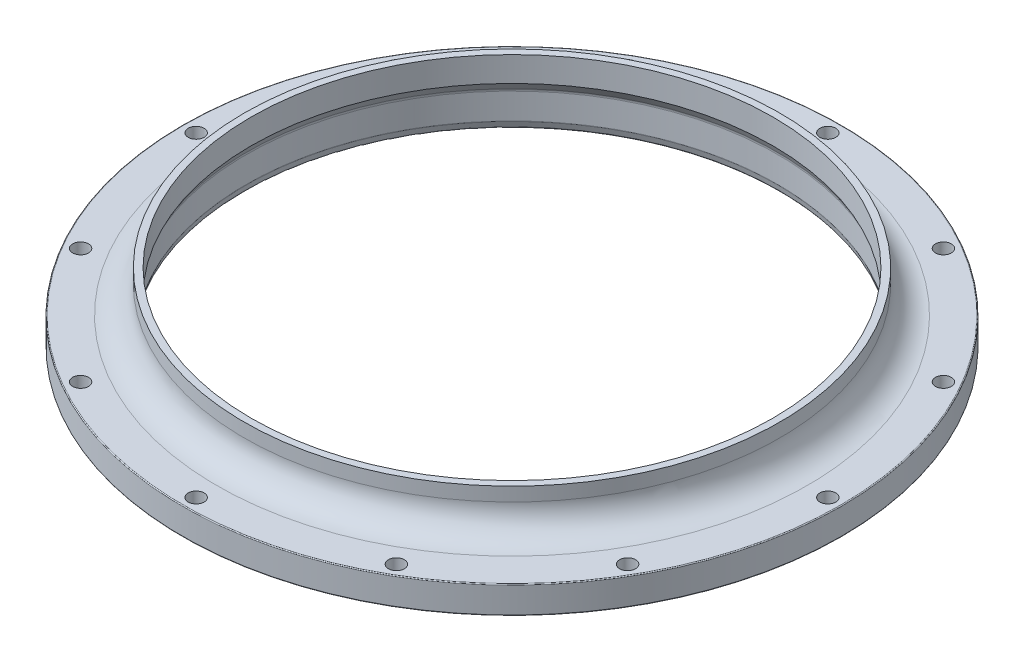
ISO-10303-21;
HEADER;
FILE_DESCRIPTION(('STEP AP214'),'2;1');
FILE_NAME('part.step','',(''),(''),'','','');
FILE_SCHEMA(('AUTOMOTIVE_DESIGN { 1 0 10303 214 1 1 1 1 }'));
ENDSEC;
DATA;
#1=APPLICATION_CONTEXT('core data for automotive mechanical design processes');
#2=APPLICATION_PROTOCOL_DEFINITION('international standard','automotive_design',2000,#1);
#3=PRODUCT_CONTEXT('',#1,'mechanical');
#4=PRODUCT('Part','Part','',(#3));
#5=PRODUCT_RELATED_PRODUCT_CATEGORY('part','',(#4));
#6=PRODUCT_DEFINITION_FORMATION('','',#4);
#7=PRODUCT_DEFINITION_CONTEXT('part definition',#1,'design');
#8=PRODUCT_DEFINITION('design','',#6,#7);
#9=PRODUCT_DEFINITION_SHAPE('','',#8);
#10=(LENGTH_UNIT() NAMED_UNIT(*) SI_UNIT(.MILLI.,.METRE.));
#11=(NAMED_UNIT(*) PLANE_ANGLE_UNIT() SI_UNIT($,.RADIAN.));
#12=(NAMED_UNIT(*) SI_UNIT($,.STERADIAN.) SOLID_ANGLE_UNIT());
#13=UNCERTAINTY_MEASURE_WITH_UNIT(LENGTH_MEASURE(1.E-05),#10,'distance_accuracy_value','');
#14=(GEOMETRIC_REPRESENTATION_CONTEXT(3) GLOBAL_UNCERTAINTY_ASSIGNED_CONTEXT((#13)) GLOBAL_UNIT_ASSIGNED_CONTEXT((#10,
#11,#12)) REPRESENTATION_CONTEXT('',''));
#15=CARTESIAN_POINT('',(0.,0.,0.));
#16=DIRECTION('',(0.,0.,1.));
#17=DIRECTION('',(1.,0.,0.));
#18=AXIS2_PLACEMENT_3D('',#15,#16,#17);
#19=CARTESIAN_POINT('',(0.,0.,0.));
#20=DIRECTION('',(0.,-1.,0.));
#21=DIRECTION('',(-1.,0.,0.));
#22=AXIS2_PLACEMENT_3D('',#19,#20,#21);
#23=CYLINDRICAL_SURFACE('',#22,241.3);
#24=CARTESIAN_POINT('',(0.,-247.65,0.));
#25=DIRECTION('',(0.,1.,0.));
#26=DIRECTION('',(-1.,0.,0.));
#27=AXIS2_PLACEMENT_3D('',#24,#25,#26);
#28=CIRCLE('',#27,241.3);
#29=CARTESIAN_POINT('',(-241.3,-247.65,0.));
#30=VERTEX_POINT('',#29);
#31=EDGE_CURVE('E46',#30,#30,#28,.T.);
#32=ORIENTED_EDGE('',*,*,#31,.T.);
#33=EDGE_LOOP('',(#32));
#34=FACE_BOUND('',#33,.T.);
#35=CARTESIAN_POINT('',(0.,-270.747029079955,0.));
#36=DIRECTION('',(0.,1.,0.));
#37=DIRECTION('',(0.,0.,1.));
#38=AXIS2_PLACEMENT_3D('',#35,#36,#37);
#39=CIRCLE('',#38,241.3);
#40=CARTESIAN_POINT('',(0.,-270.747029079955,241.3));
#41=VERTEX_POINT('',#40);
#42=EDGE_CURVE('E145',#41,#41,#39,.T.);
#43=ORIENTED_EDGE('',*,*,#42,.F.);
#44=EDGE_LOOP('',(#43));
#45=FACE_BOUND('',#44,.T.);
#46=ADVANCED_FACE('F35',(#34,#45),#23,.F.);
#47=CARTESIAN_POINT('',(241.3,-247.65,0.));
#48=DIRECTION('',(0.,-1.,0.));
#49=DIRECTION('',(-1.,0.,0.));
#50=AXIS2_PLACEMENT_3D('',#47,#48,#49);
#51=PLANE('',#50);
#52=CARTESIAN_POINT('',(0.,-247.65,0.));
#53=DIRECTION('',(0.,1.,0.));
#54=DIRECTION('',(-1.,0.,0.));
#55=AXIS2_PLACEMENT_3D('',#52,#53,#54);
#56=CIRCLE('',#55,247.65);
#57=CARTESIAN_POINT('',(-247.65,-247.65,0.));
#58=VERTEX_POINT('',#57);
#59=EDGE_CURVE('E89',#58,#58,#56,.T.);
#60=ORIENTED_EDGE('',*,*,#59,.T.);
#61=EDGE_LOOP('',(#60));
#62=FACE_BOUND('',#61,.T.);
#63=ORIENTED_EDGE('',*,*,#31,.F.);
#64=EDGE_LOOP('',(#63));
#65=FACE_BOUND('',#64,.T.);
#66=ADVANCED_FACE('F177',(#62,#65),#51,.F.);
#67=CARTESIAN_POINT('',(304.00625,-311.15,0.));
#68=DIRECTION('',(0.,1.,0.));
#69=DIRECTION('',(1.,0.,0.));
#70=AXIS2_PLACEMENT_3D('',#67,#68,#69);
#71=PLANE('',#70);
#72=CARTESIAN_POINT('',(0.,-311.15,0.));
#73=DIRECTION('',(0.,1.,0.));
#74=DIRECTION('',(-1.,0.,0.));
#75=AXIS2_PLACEMENT_3D('',#72,#73,#74);
#76=CIRCLE('',#75,249.090381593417);
#77=CARTESIAN_POINT('',(-249.090381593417,-311.15,0.));
#78=VERTEX_POINT('',#77);
#79=EDGE_CURVE('E42',#78,#78,#76,.T.);
#80=ORIENTED_EDGE('',*,*,#79,.T.);
#81=EDGE_LOOP('',(#80));
#82=FACE_BOUND('',#81,.T.);
#83=CARTESIAN_POINT('',(-1.40812414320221E-13,-311.15,292.1));
#84=DIRECTION('',(0.,1.,0.));
#85=DIRECTION('',(-1.,0.,0.));
#86=AXIS2_PLACEMENT_3D('',#83,#84,#85);
#87=CIRCLE('',#86,7.34186999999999);
#88=CARTESIAN_POINT('',(-7.34187000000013,-311.15,292.1));
#89=VERTEX_POINT('',#88);
#90=EDGE_CURVE('E53',#89,#89,#87,.T.);
#91=ORIENTED_EDGE('',*,*,#90,.T.);
#92=EDGE_LOOP('',(#91));
#93=FACE_BOUND('',#92,.T.);
#94=CARTESIAN_POINT('',(-146.05,-311.15,252.966020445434));
#95=DIRECTION('',(0.,1.,0.));
#96=DIRECTION('',(-1.,0.,0.));
#97=AXIS2_PLACEMENT_3D('',#94,#95,#96);
#98=CIRCLE('',#97,7.34187);
#99=CARTESIAN_POINT('',(-153.39187,-311.15,252.966020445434));
#100=VERTEX_POINT('',#99);
#101=EDGE_CURVE('E58',#100,#100,#98,.T.);
#102=ORIENTED_EDGE('',*,*,#101,.T.);
#103=EDGE_LOOP('',(#102));
#104=FACE_BOUND('',#103,.T.);
#105=CARTESIAN_POINT('',(-252.966020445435,-311.15,146.049999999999));
#106=DIRECTION('',(0.,1.,0.));
#107=DIRECTION('',(-1.,0.,0.));
#108=AXIS2_PLACEMENT_3D('',#105,#106,#107);
#109=CIRCLE('',#108,7.34187);
#110=CARTESIAN_POINT('',(-260.307890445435,-311.15,146.049999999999));
#111=VERTEX_POINT('',#110);
#112=EDGE_CURVE('E136',#111,#111,#109,.T.);
#113=ORIENTED_EDGE('',*,*,#112,.T.);
#114=EDGE_LOOP('',(#113));
#115=FACE_BOUND('',#114,.T.);
#116=CARTESIAN_POINT('',(-292.1,-311.15,-1.12410081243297E-12));
#117=DIRECTION('',(0.,1.,0.));
#118=DIRECTION('',(-1.,0.,0.));
#119=AXIS2_PLACEMENT_3D('',#116,#117,#118);
#120=CIRCLE('',#119,7.34186999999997);
#121=CARTESIAN_POINT('',(-299.44187,-311.15,-1.12410081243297E-12));
#122=VERTEX_POINT('',#121);
#123=EDGE_CURVE('E62',#122,#122,#120,.T.);
#124=ORIENTED_EDGE('',*,*,#123,.T.);
#125=EDGE_LOOP('',(#124));
#126=FACE_BOUND('',#125,.T.);
#127=CARTESIAN_POINT('',(-252.966020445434,-311.15,-146.050000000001));
#128=DIRECTION('',(0.,1.,0.));
#129=DIRECTION('',(-1.,0.,0.));
#130=AXIS2_PLACEMENT_3D('',#127,#128,#129);
#131=CIRCLE('',#130,7.34187);
#132=CARTESIAN_POINT('',(-260.307890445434,-311.15,-146.050000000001));
#133=VERTEX_POINT('',#132);
#134=EDGE_CURVE('E129',#133,#133,#131,.T.);
#135=ORIENTED_EDGE('',*,*,#134,.T.);
#136=EDGE_LOOP('',(#135));
#137=FACE_BOUND('',#136,.T.);
#138=CARTESIAN_POINT('',(-146.049999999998,-311.15,-252.966020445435));
#139=DIRECTION('',(0.,1.,0.));
#140=DIRECTION('',(-1.,0.,0.));
#141=AXIS2_PLACEMENT_3D('',#138,#139,#140);
#142=CIRCLE('',#141,7.34187);
#143=CARTESIAN_POINT('',(-153.391869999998,-311.15,-252.966020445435));
#144=VERTEX_POINT('',#143);
#145=EDGE_CURVE('E123',#144,#144,#142,.T.);
#146=ORIENTED_EDGE('',*,*,#145,.T.);
#147=EDGE_LOOP('',(#146));
#148=FACE_BOUND('',#147,.T.);
#149=CARTESIAN_POINT('',(2.10218504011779E-12,-311.15,-292.1));
#150=DIRECTION('',(0.,1.,0.));
#151=DIRECTION('',(-1.,0.,0.));
#152=AXIS2_PLACEMENT_3D('',#149,#150,#151);
#153=CIRCLE('',#152,7.34186999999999);
#154=CARTESIAN_POINT('',(-7.34186999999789,-311.15,-292.1));
#155=VERTEX_POINT('',#154);
#156=EDGE_CURVE('E67',#155,#155,#153,.T.);
#157=ORIENTED_EDGE('',*,*,#156,.T.);
#158=EDGE_LOOP('',(#157));
#159=FACE_BOUND('',#158,.T.);
#160=CARTESIAN_POINT('',(146.050000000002,-311.15,-252.966020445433));
#161=DIRECTION('',(0.,1.,0.));
#162=DIRECTION('',(-1.,0.,0.));
#163=AXIS2_PLACEMENT_3D('',#160,#161,#162);
#164=CIRCLE('',#163,7.34187);
#165=CARTESIAN_POINT('',(138.708130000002,-311.15,-252.966020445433));
#166=VERTEX_POINT('',#165);
#167=EDGE_CURVE('E116',#166,#166,#164,.T.);
#168=ORIENTED_EDGE('',*,*,#167,.T.);
#169=EDGE_LOOP('',(#168));
#170=FACE_BOUND('',#169,.T.);
#171=CARTESIAN_POINT('',(252.966020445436,-311.15,-146.049999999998));
#172=DIRECTION('',(0.,1.,0.));
#173=DIRECTION('',(-1.,0.,0.));
#174=AXIS2_PLACEMENT_3D('',#171,#172,#173);
#175=CIRCLE('',#174,7.34186999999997);
#176=CARTESIAN_POINT('',(245.624150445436,-311.15,-146.049999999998));
#177=VERTEX_POINT('',#176);
#178=EDGE_CURVE('E110',#177,#177,#175,.T.);
#179=ORIENTED_EDGE('',*,*,#178,.T.);
#180=EDGE_LOOP('',(#179));
#181=FACE_BOUND('',#180,.T.);
#182=CARTESIAN_POINT('',(292.1,-311.15,3.1641356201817E-12));
#183=DIRECTION('',(0.,1.,0.));
#184=DIRECTION('',(-1.,0.,0.));
#185=AXIS2_PLACEMENT_3D('',#182,#183,#184);
#186=CIRCLE('',#185,7.34186999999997);
#187=CARTESIAN_POINT('',(284.75813,-311.15,3.1641356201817E-12));
#188=VERTEX_POINT('',#187);
#189=EDGE_CURVE('E104',#188,#188,#186,.T.);
#190=ORIENTED_EDGE('',*,*,#189,.T.);
#191=EDGE_LOOP('',(#190));
#192=FACE_BOUND('',#191,.T.);
#193=CARTESIAN_POINT('',(252.966020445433,-311.15,146.050000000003));
#194=DIRECTION('',(0.,1.,0.));
#195=DIRECTION('',(-1.,0.,0.));
#196=AXIS2_PLACEMENT_3D('',#193,#194,#195);
#197=CIRCLE('',#196,7.34186999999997);
#198=CARTESIAN_POINT('',(245.624150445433,-311.15,146.050000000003));
#199=VERTEX_POINT('',#198);
#200=EDGE_CURVE('E98',#199,#199,#197,.T.);
#201=ORIENTED_EDGE('',*,*,#200,.T.);
#202=EDGE_LOOP('',(#201));
#203=FACE_BOUND('',#202,.T.);
#204=CARTESIAN_POINT('',(146.049999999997,-311.15,252.966020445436));
#205=DIRECTION('',(0.,1.,0.));
#206=DIRECTION('',(-1.,0.,0.));
#207=AXIS2_PLACEMENT_3D('',#204,#205,#206);
#208=CIRCLE('',#207,7.34187);
#209=CARTESIAN_POINT('',(138.708129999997,-311.15,252.966020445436));
#210=VERTEX_POINT('',#209);
#211=EDGE_CURVE('E92',#210,#210,#208,.T.);
#212=ORIENTED_EDGE('',*,*,#211,.T.);
#213=EDGE_LOOP('',(#212));
#214=FACE_BOUND('',#213,.T.);
#215=CARTESIAN_POINT('',(0.,-311.15,0.));
#216=DIRECTION('',(0.,1.,0.));
#217=DIRECTION('',(-1.,0.,0.));
#218=AXIS2_PLACEMENT_3D('',#215,#216,#217);
#219=CIRCLE('',#218,304.00625);
#220=CARTESIAN_POINT('',(-304.00625,-311.15,0.));
#221=VERTEX_POINT('',#220);
#222=EDGE_CURVE('E50',#221,#221,#219,.T.);
#223=ORIENTED_EDGE('',*,*,#222,.F.);
#224=EDGE_LOOP('',(#223));
#225=FACE_BOUND('',#224,.T.);
#226=ADVANCED_FACE('F183',(#82,#93,#104,#115,#126,#137,#148,#159,#170,#181,#192,#203,#214,#225),
#71,.F.);
#227=CARTESIAN_POINT('',(0.,-310.35625,0.));
#228=DIRECTION('',(0.,-1.,0.));
#229=DIRECTION('',(-1.,0.,0.));
#230=AXIS2_PLACEMENT_3D('',#227,#228,#229);
#231=TOROIDAL_SURFACE('',#230,304.00625,0.793749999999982);
#232=ORIENTED_EDGE('',*,*,#222,.T.);
#233=EDGE_LOOP('',(#232));
#234=FACE_BOUND('',#233,.T.);
#235=CARTESIAN_POINT('',(0.,-310.35625,0.));
#236=DIRECTION('',(0.,1.,0.));
#237=DIRECTION('',(-1.,0.,0.));
#238=AXIS2_PLACEMENT_3D('',#235,#236,#237);
#239=CIRCLE('',#238,304.8);
#240=CARTESIAN_POINT('',(-304.8,-310.35625,0.));
#241=VERTEX_POINT('',#240);
#242=EDGE_CURVE('E74',#241,#241,#239,.T.);
#243=ORIENTED_EDGE('',*,*,#242,.F.);
#244=EDGE_LOOP('',(#243));
#245=FACE_BOUND('',#244,.T.);
#246=ADVANCED_FACE('F189',(#234,#245),#231,.T.);
#247=CARTESIAN_POINT('',(0.,0.,0.));
#248=DIRECTION('',(0.,-1.,0.));
#249=DIRECTION('',(-1.,0.,0.));
#250=AXIS2_PLACEMENT_3D('',#247,#248,#249);
#251=CYLINDRICAL_SURFACE('',#250,304.8);
#252=ORIENTED_EDGE('',*,*,#242,.T.);
#253=EDGE_LOOP('',(#252));
#254=FACE_BOUND('',#253,.T.);
#255=CARTESIAN_POINT('',(0.,-286.54375,0.));
#256=DIRECTION('',(0.,1.,0.));
#257=DIRECTION('',(-1.,0.,0.));
#258=AXIS2_PLACEMENT_3D('',#255,#256,#257);
#259=CIRCLE('',#258,304.8);
#260=CARTESIAN_POINT('',(-304.8,-286.54375,0.));
#261=VERTEX_POINT('',#260);
#262=EDGE_CURVE('E77',#261,#261,#259,.T.);
#263=ORIENTED_EDGE('',*,*,#262,.F.);
#264=EDGE_LOOP('',(#263));
#265=FACE_BOUND('',#264,.T.);
#266=ADVANCED_FACE('F192',(#254,#265),#251,.T.);
#267=CARTESIAN_POINT('',(0.,-286.54375,0.));
#268=DIRECTION('',(0.,-1.,0.));
#269=DIRECTION('',(-1.,0.,0.));
#270=AXIS2_PLACEMENT_3D('',#267,#268,#269);
#271=TOROIDAL_SURFACE('',#270,304.00625,0.793749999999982);
#272=ORIENTED_EDGE('',*,*,#262,.T.);
#273=EDGE_LOOP('',(#272));
#274=FACE_BOUND('',#273,.T.);
#275=CARTESIAN_POINT('',(0.,-285.75,0.));
#276=DIRECTION('',(0.,1.,0.));
#277=DIRECTION('',(-1.,0.,0.));
#278=AXIS2_PLACEMENT_3D('',#275,#276,#277);
#279=CIRCLE('',#278,304.00625);
#280=CARTESIAN_POINT('',(-304.00625,-285.75,0.));
#281=VERTEX_POINT('',#280);
#282=EDGE_CURVE('E80',#281,#281,#279,.T.);
#283=ORIENTED_EDGE('',*,*,#282,.F.);
#284=EDGE_LOOP('',(#283));
#285=FACE_BOUND('',#284,.T.);
#286=ADVANCED_FACE('F196',(#274,#285),#271,.T.);
#287=CARTESIAN_POINT('',(273.05,-285.75,0.));
#288=DIRECTION('',(0.,-1.,0.));
#289=DIRECTION('',(-1.,0.,0.));
#290=AXIS2_PLACEMENT_3D('',#287,#288,#289);
#291=PLANE('',#290);
#292=CARTESIAN_POINT('',(-1.40812414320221E-13,-285.75,292.1));
#293=DIRECTION('',(0.,1.,0.));
#294=DIRECTION('',(0.,0.,1.));
#295=AXIS2_PLACEMENT_3D('',#292,#293,#294);
#296=CIRCLE('',#295,7.34187);
#297=CARTESIAN_POINT('',(-1.40812414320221E-13,-285.75,299.44187));
#298=VERTEX_POINT('',#297);
#299=EDGE_CURVE('E57',#298,#298,#296,.T.);
#300=ORIENTED_EDGE('',*,*,#299,.F.);
#301=EDGE_LOOP('',(#300));
#302=FACE_BOUND('',#301,.T.);
#303=CARTESIAN_POINT('',(-146.05,-285.75,252.966020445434));
#304=DIRECTION('',(0.,1.,0.));
#305=DIRECTION('',(0.,0.,1.));
#306=AXIS2_PLACEMENT_3D('',#303,#304,#305);
#307=CIRCLE('',#306,7.34187);
#308=CARTESIAN_POINT('',(-146.05,-285.75,260.307890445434));
#309=VERTEX_POINT('',#308);
#310=EDGE_CURVE('E56',#309,#309,#307,.T.);
#311=ORIENTED_EDGE('',*,*,#310,.F.);
#312=EDGE_LOOP('',(#311));
#313=FACE_BOUND('',#312,.T.);
#314=CARTESIAN_POINT('',(-252.966020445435,-285.75,146.049999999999));
#315=DIRECTION('',(0.,1.,0.));
#316=DIRECTION('',(0.,0.,1.));
#317=AXIS2_PLACEMENT_3D('',#314,#315,#316);
#318=CIRCLE('',#317,7.34187);
#319=CARTESIAN_POINT('',(-252.966020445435,-285.75,153.391869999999));
#320=VERTEX_POINT('',#319);
#321=EDGE_CURVE('E61',#320,#320,#318,.T.);
#322=ORIENTED_EDGE('',*,*,#321,.F.);
#323=EDGE_LOOP('',(#322));
#324=FACE_BOUND('',#323,.T.);
#325=CARTESIAN_POINT('',(-292.1,-285.75,-1.12410081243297E-12));
#326=DIRECTION('',(0.,1.,0.));
#327=DIRECTION('',(0.,0.,1.));
#328=AXIS2_PLACEMENT_3D('',#325,#326,#327);
#329=CIRCLE('',#328,7.34186999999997);
#330=CARTESIAN_POINT('',(-292.1,-285.75,7.34186999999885));
#331=VERTEX_POINT('',#330);
#332=EDGE_CURVE('E66',#331,#331,#329,.T.);
#333=ORIENTED_EDGE('',*,*,#332,.F.);
#334=EDGE_LOOP('',(#333));
#335=FACE_BOUND('',#334,.T.);
#336=CARTESIAN_POINT('',(-252.966020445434,-285.75,-146.050000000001));
#337=DIRECTION('',(0.,1.,0.));
#338=DIRECTION('',(0.,0.,1.));
#339=AXIS2_PLACEMENT_3D('',#336,#337,#338);
#340=CIRCLE('',#339,7.34187);
#341=CARTESIAN_POINT('',(-252.966020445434,-285.75,-138.708130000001));
#342=VERTEX_POINT('',#341);
#343=EDGE_CURVE('E65',#342,#342,#340,.T.);
#344=ORIENTED_EDGE('',*,*,#343,.F.);
#345=EDGE_LOOP('',(#344));
#346=FACE_BOUND('',#345,.T.);
#347=CARTESIAN_POINT('',(-146.049999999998,-285.75,-252.966020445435));
#348=DIRECTION('',(0.,1.,0.));
#349=DIRECTION('',(0.,0.,1.));
#350=AXIS2_PLACEMENT_3D('',#347,#348,#349);
#351=CIRCLE('',#350,7.34187);
#352=CARTESIAN_POINT('',(-146.049999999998,-285.75,-245.624150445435));
#353=VERTEX_POINT('',#352);
#354=EDGE_CURVE('E126',#353,#353,#351,.T.);
#355=ORIENTED_EDGE('',*,*,#354,.F.);
#356=EDGE_LOOP('',(#355));
#357=FACE_BOUND('',#356,.T.);
#358=CARTESIAN_POINT('',(2.10218504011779E-12,-285.75,-292.1));
#359=DIRECTION('',(0.,1.,0.));
#360=DIRECTION('',(0.,0.,1.));
#361=AXIS2_PLACEMENT_3D('',#358,#359,#360);
#362=CIRCLE('',#361,7.34187);
#363=CARTESIAN_POINT('',(2.10218504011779E-12,-285.75,-284.75813));
#364=VERTEX_POINT('',#363);
#365=EDGE_CURVE('E70',#364,#364,#362,.T.);
#366=ORIENTED_EDGE('',*,*,#365,.F.);
#367=EDGE_LOOP('',(#366));
#368=FACE_BOUND('',#367,.T.);
#369=CARTESIAN_POINT('',(146.050000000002,-285.75,-252.966020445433));
#370=DIRECTION('',(0.,1.,0.));
#371=DIRECTION('',(0.,0.,1.));
#372=AXIS2_PLACEMENT_3D('',#369,#370,#371);
#373=CIRCLE('',#372,7.34187);
#374=CARTESIAN_POINT('',(146.050000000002,-285.75,-245.624150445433));
#375=VERTEX_POINT('',#374);
#376=EDGE_CURVE('E69',#375,#375,#373,.T.);
#377=ORIENTED_EDGE('',*,*,#376,.F.);
#378=EDGE_LOOP('',(#377));
#379=FACE_BOUND('',#378,.T.);
#380=CARTESIAN_POINT('',(252.966020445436,-285.75,-146.049999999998));
#381=DIRECTION('',(0.,1.,0.));
#382=DIRECTION('',(0.,0.,1.));
#383=AXIS2_PLACEMENT_3D('',#380,#381,#382);
#384=CIRCLE('',#383,7.34186999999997);
#385=CARTESIAN_POINT('',(252.966020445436,-285.75,-138.708129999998));
#386=VERTEX_POINT('',#385);
#387=EDGE_CURVE('E113',#386,#386,#384,.T.);
#388=ORIENTED_EDGE('',*,*,#387,.F.);
#389=EDGE_LOOP('',(#388));
#390=FACE_BOUND('',#389,.T.);
#391=CARTESIAN_POINT('',(292.1,-285.75,3.1641356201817E-12));
#392=DIRECTION('',(0.,1.,0.));
#393=DIRECTION('',(0.,0.,1.));
#394=AXIS2_PLACEMENT_3D('',#391,#392,#393);
#395=CIRCLE('',#394,7.34186999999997);
#396=CARTESIAN_POINT('',(292.1,-285.75,7.34187000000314));
#397=VERTEX_POINT('',#396);
#398=EDGE_CURVE('E107',#397,#397,#395,.T.);
#399=ORIENTED_EDGE('',*,*,#398,.F.);
#400=EDGE_LOOP('',(#399));
#401=FACE_BOUND('',#400,.T.);
#402=CARTESIAN_POINT('',(252.966020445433,-285.75,146.050000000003));
#403=DIRECTION('',(0.,1.,0.));
#404=DIRECTION('',(0.,0.,1.));
#405=AXIS2_PLACEMENT_3D('',#402,#403,#404);
#406=CIRCLE('',#405,7.34186999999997);
#407=CARTESIAN_POINT('',(252.966020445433,-285.75,153.391870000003));
#408=VERTEX_POINT('',#407);
#409=EDGE_CURVE('E101',#408,#408,#406,.T.);
#410=ORIENTED_EDGE('',*,*,#409,.F.);
#411=EDGE_LOOP('',(#410));
#412=FACE_BOUND('',#411,.T.);
#413=CARTESIAN_POINT('',(146.049999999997,-285.75,252.966020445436));
#414=DIRECTION('',(0.,1.,0.));
#415=DIRECTION('',(0.,0.,1.));
#416=AXIS2_PLACEMENT_3D('',#413,#414,#415);
#417=CIRCLE('',#416,7.34187);
#418=CARTESIAN_POINT('',(146.049999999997,-285.75,260.307890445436));
#419=VERTEX_POINT('',#418);
#420=EDGE_CURVE('E95',#419,#419,#417,.T.);
#421=ORIENTED_EDGE('',*,*,#420,.F.);
#422=EDGE_LOOP('',(#421));
#423=FACE_BOUND('',#422,.T.);
#424=ORIENTED_EDGE('',*,*,#282,.T.);
#425=EDGE_LOOP('',(#424));
#426=FACE_BOUND('',#425,.T.);
#427=CARTESIAN_POINT('',(0.,-285.75,0.));
#428=DIRECTION('',(0.,1.,0.));
#429=DIRECTION('',(-1.,0.,0.));
#430=AXIS2_PLACEMENT_3D('',#427,#428,#429);
#431=CIRCLE('',#430,273.05);
#432=CARTESIAN_POINT('',(-273.05,-285.75,0.));
#433=VERTEX_POINT('',#432);
#434=EDGE_CURVE('E83',#433,#433,#431,.T.);
#435=ORIENTED_EDGE('',*,*,#434,.F.);
#436=EDGE_LOOP('',(#435));
#437=FACE_BOUND('',#436,.T.);
#438=ADVANCED_FACE('F200',(#302,#313,#324,#335,#346,#357,#368,#379,#390,#401,#412,#423,#426,
#437),#291,.F.);
#439=CARTESIAN_POINT('',(0.,-260.35,0.));
#440=DIRECTION('',(0.,-1.,0.));
#441=DIRECTION('',(-1.,0.,0.));
#442=AXIS2_PLACEMENT_3D('',#439,#440,#441);
#443=TOROIDAL_SURFACE('',#442,273.05,25.4);
#444=ORIENTED_EDGE('',*,*,#434,.T.);
#445=EDGE_LOOP('',(#444));
#446=FACE_BOUND('',#445,.T.);
#447=CARTESIAN_POINT('',(0.,-260.35,0.));
#448=DIRECTION('',(0.,1.,0.));
#449=DIRECTION('',(-1.,0.,0.));
#450=AXIS2_PLACEMENT_3D('',#447,#448,#449);
#451=CIRCLE('',#450,247.65);
#452=CARTESIAN_POINT('',(-247.65,-260.35,0.));
#453=VERTEX_POINT('',#452);
#454=EDGE_CURVE('E86',#453,#453,#451,.T.);
#455=ORIENTED_EDGE('',*,*,#454,.F.);
#456=EDGE_LOOP('',(#455));
#457=FACE_BOUND('',#456,.T.);
#458=ADVANCED_FACE('F204',(#446,#457),#443,.F.);
#459=CARTESIAN_POINT('',(0.,0.,0.));
#460=DIRECTION('',(0.,-1.,0.));
#461=DIRECTION('',(-1.,0.,0.));
#462=AXIS2_PLACEMENT_3D('',#459,#460,#461);
#463=CYLINDRICAL_SURFACE('',#462,247.65);
#464=ORIENTED_EDGE('',*,*,#454,.T.);
#465=EDGE_LOOP('',(#464));
#466=FACE_BOUND('',#465,.T.);
#467=ORIENTED_EDGE('',*,*,#59,.F.);
#468=EDGE_LOOP('',(#467));
#469=FACE_BOUND('',#468,.T.);
#470=ADVANCED_FACE('F208',(#466,#469),#463,.T.);
#471=CARTESIAN_POINT('',(146.049999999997,-285.75,252.966020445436));
#472=DIRECTION('',(0.,1.,0.));
#473=DIRECTION('',(0.,0.,1.));
#474=AXIS2_PLACEMENT_3D('',#471,#472,#473);
#475=CYLINDRICAL_SURFACE('',#474,7.34187);
#476=ORIENTED_EDGE('',*,*,#420,.T.);
#477=EDGE_LOOP('',(#476));
#478=FACE_BOUND('',#477,.T.);
#479=ORIENTED_EDGE('',*,*,#211,.F.);
#480=EDGE_LOOP('',(#479));
#481=FACE_BOUND('',#480,.T.);
#482=ADVANCED_FACE('F212',(#478,#481),#475,.F.);
#483=CARTESIAN_POINT('',(252.966020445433,-285.75,146.050000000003));
#484=DIRECTION('',(0.,1.,0.));
#485=DIRECTION('',(0.,0.,1.));
#486=AXIS2_PLACEMENT_3D('',#483,#484,#485);
#487=CYLINDRICAL_SURFACE('',#486,7.34186999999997);
#488=ORIENTED_EDGE('',*,*,#409,.T.);
#489=EDGE_LOOP('',(#488));
#490=FACE_BOUND('',#489,.T.);
#491=ORIENTED_EDGE('',*,*,#200,.F.);
#492=EDGE_LOOP('',(#491));
#493=FACE_BOUND('',#492,.T.);
#494=ADVANCED_FACE('F216',(#490,#493),#487,.F.);
#495=CARTESIAN_POINT('',(292.1,-285.75,3.1641356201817E-12));
#496=DIRECTION('',(0.,1.,0.));
#497=DIRECTION('',(0.,0.,1.));
#498=AXIS2_PLACEMENT_3D('',#495,#496,#497);
#499=CYLINDRICAL_SURFACE('',#498,7.34186999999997);
#500=ORIENTED_EDGE('',*,*,#398,.T.);
#501=EDGE_LOOP('',(#500));
#502=FACE_BOUND('',#501,.T.);
#503=ORIENTED_EDGE('',*,*,#189,.F.);
#504=EDGE_LOOP('',(#503));
#505=FACE_BOUND('',#504,.T.);
#506=ADVANCED_FACE('F220',(#502,#505),#499,.F.);
#507=CARTESIAN_POINT('',(252.966020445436,-285.75,-146.049999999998));
#508=DIRECTION('',(0.,1.,0.));
#509=DIRECTION('',(0.,0.,1.));
#510=AXIS2_PLACEMENT_3D('',#507,#508,#509);
#511=CYLINDRICAL_SURFACE('',#510,7.34186999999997);
#512=ORIENTED_EDGE('',*,*,#387,.T.);
#513=EDGE_LOOP('',(#512));
#514=FACE_BOUND('',#513,.T.);
#515=ORIENTED_EDGE('',*,*,#178,.F.);
#516=EDGE_LOOP('',(#515));
#517=FACE_BOUND('',#516,.T.);
#518=ADVANCED_FACE('F224',(#514,#517),#511,.F.);
#519=CARTESIAN_POINT('',(146.050000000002,-285.75,-252.966020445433));
#520=DIRECTION('',(0.,1.,0.));
#521=DIRECTION('',(0.,0.,1.));
#522=AXIS2_PLACEMENT_3D('',#519,#520,#521);
#523=CYLINDRICAL_SURFACE('',#522,7.34187);
#524=ORIENTED_EDGE('',*,*,#376,.T.);
#525=EDGE_LOOP('',(#524));
#526=FACE_BOUND('',#525,.T.);
#527=ORIENTED_EDGE('',*,*,#167,.F.);
#528=EDGE_LOOP('',(#527));
#529=FACE_BOUND('',#528,.T.);
#530=ADVANCED_FACE('F228',(#526,#529),#523,.F.);
#531=CARTESIAN_POINT('',(2.10218504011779E-12,-285.75,-292.1));
#532=DIRECTION('',(0.,1.,0.));
#533=DIRECTION('',(0.,0.,1.));
#534=AXIS2_PLACEMENT_3D('',#531,#532,#533);
#535=CYLINDRICAL_SURFACE('',#534,7.34186999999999);
#536=ORIENTED_EDGE('',*,*,#365,.T.);
#537=EDGE_LOOP('',(#536));
#538=FACE_BOUND('',#537,.T.);
#539=ORIENTED_EDGE('',*,*,#156,.F.);
#540=EDGE_LOOP('',(#539));
#541=FACE_BOUND('',#540,.T.);
#542=ADVANCED_FACE('F232',(#538,#541),#535,.F.);
#543=CARTESIAN_POINT('',(-146.049999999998,-285.75,-252.966020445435));
#544=DIRECTION('',(0.,1.,0.));
#545=DIRECTION('',(0.,0.,1.));
#546=AXIS2_PLACEMENT_3D('',#543,#544,#545);
#547=CYLINDRICAL_SURFACE('',#546,7.34187);
#548=ORIENTED_EDGE('',*,*,#354,.T.);
#549=EDGE_LOOP('',(#548));
#550=FACE_BOUND('',#549,.T.);
#551=ORIENTED_EDGE('',*,*,#145,.F.);
#552=EDGE_LOOP('',(#551));
#553=FACE_BOUND('',#552,.T.);
#554=ADVANCED_FACE('F236',(#550,#553),#547,.F.);
#555=CARTESIAN_POINT('',(-252.966020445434,-285.75,-146.050000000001));
#556=DIRECTION('',(0.,1.,0.));
#557=DIRECTION('',(0.,0.,1.));
#558=AXIS2_PLACEMENT_3D('',#555,#556,#557);
#559=CYLINDRICAL_SURFACE('',#558,7.34187);
#560=ORIENTED_EDGE('',*,*,#343,.T.);
#561=EDGE_LOOP('',(#560));
#562=FACE_BOUND('',#561,.T.);
#563=ORIENTED_EDGE('',*,*,#134,.F.);
#564=EDGE_LOOP('',(#563));
#565=FACE_BOUND('',#564,.T.);
#566=ADVANCED_FACE('F240',(#562,#565),#559,.F.);
#567=CARTESIAN_POINT('',(-292.1,-285.75,-1.12410081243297E-12));
#568=DIRECTION('',(0.,1.,0.));
#569=DIRECTION('',(0.,0.,1.));
#570=AXIS2_PLACEMENT_3D('',#567,#568,#569);
#571=CYLINDRICAL_SURFACE('',#570,7.34186999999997);
#572=ORIENTED_EDGE('',*,*,#332,.T.);
#573=EDGE_LOOP('',(#572));
#574=FACE_BOUND('',#573,.T.);
#575=ORIENTED_EDGE('',*,*,#123,.F.);
#576=EDGE_LOOP('',(#575));
#577=FACE_BOUND('',#576,.T.);
#578=ADVANCED_FACE('F244',(#574,#577),#571,.F.);
#579=CARTESIAN_POINT('',(-252.966020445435,-285.75,146.049999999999));
#580=DIRECTION('',(0.,1.,0.));
#581=DIRECTION('',(0.,0.,1.));
#582=AXIS2_PLACEMENT_3D('',#579,#580,#581);
#583=CYLINDRICAL_SURFACE('',#582,7.34187);
#584=ORIENTED_EDGE('',*,*,#321,.T.);
#585=EDGE_LOOP('',(#584));
#586=FACE_BOUND('',#585,.T.);
#587=ORIENTED_EDGE('',*,*,#112,.F.);
#588=EDGE_LOOP('',(#587));
#589=FACE_BOUND('',#588,.T.);
#590=ADVANCED_FACE('F248',(#586,#589),#583,.F.);
#591=CARTESIAN_POINT('',(-146.05,-285.75,252.966020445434));
#592=DIRECTION('',(0.,1.,0.));
#593=DIRECTION('',(0.,0.,1.));
#594=AXIS2_PLACEMENT_3D('',#591,#592,#593);
#595=CYLINDRICAL_SURFACE('',#594,7.34187);
#596=ORIENTED_EDGE('',*,*,#310,.T.);
#597=EDGE_LOOP('',(#596));
#598=FACE_BOUND('',#597,.T.);
#599=ORIENTED_EDGE('',*,*,#101,.F.);
#600=EDGE_LOOP('',(#599));
#601=FACE_BOUND('',#600,.T.);
#602=ADVANCED_FACE('F252',(#598,#601),#595,.F.);
#603=CARTESIAN_POINT('',(-1.40812414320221E-13,-285.75,292.1));
#604=DIRECTION('',(0.,1.,0.));
#605=DIRECTION('',(0.,0.,1.));
#606=AXIS2_PLACEMENT_3D('',#603,#604,#605);
#607=CYLINDRICAL_SURFACE('',#606,7.34186999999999);
#608=ORIENTED_EDGE('',*,*,#299,.T.);
#609=EDGE_LOOP('',(#608));
#610=FACE_BOUND('',#609,.T.);
#611=ORIENTED_EDGE('',*,*,#90,.F.);
#612=EDGE_LOOP('',(#611));
#613=FACE_BOUND('',#612,.T.);
#614=ADVANCED_FACE('F256',(#610,#613),#607,.F.);
#615=CARTESIAN_POINT('',(0.,-277.890779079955,0.));
#616=DIRECTION('',(0.,-1.,0.));
#617=DIRECTION('',(0.,0.,-1.));
#618=AXIS2_PLACEMENT_3D('',#615,#616,#617);
#619=CONICAL_SURFACE('',#618,245.424445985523,0.523598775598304);
#620=ORIENTED_EDGE('',*,*,#42,.T.);
#621=EDGE_LOOP('',(#620));
#622=FACE_BOUND('',#621,.T.);
#623=CARTESIAN_POINT('',(0.,-277.890779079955,0.));
#624=DIRECTION('',(0.,1.,0.));
#625=DIRECTION('',(0.,0.,1.));
#626=AXIS2_PLACEMENT_3D('',#623,#624,#625);
#627=CIRCLE('',#626,245.424445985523);
#628=CARTESIAN_POINT('',(0.,-277.890779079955,245.424445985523));
#629=VERTEX_POINT('',#628);
#630=EDGE_CURVE('E148',#629,#629,#627,.T.);
#631=ORIENTED_EDGE('',*,*,#630,.F.);
#632=EDGE_LOOP('',(#631));
#633=FACE_BOUND('',#632,.T.);
#634=ADVANCED_FACE('F260',(#622,#633),#619,.F.);
#635=CARTESIAN_POINT('',(0.,-280.272029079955,0.));
#636=DIRECTION('',(0.,1.,0.));
#637=DIRECTION('',(0.,0.,1.));
#638=AXIS2_PLACEMENT_3D('',#635,#636,#637);
#639=TOROIDAL_SURFACE('',#638,241.3,4.7625);
#640=ORIENTED_EDGE('',*,*,#630,.T.);
#641=EDGE_LOOP('',(#640));
#642=FACE_BOUND('',#641,.T.);
#643=CARTESIAN_POINT('',(0.,-280.272029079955,0.));
#644=DIRECTION('',(0.,1.,0.));
#645=DIRECTION('',(0.,0.,1.));
#646=AXIS2_PLACEMENT_3D('',#643,#644,#645);
#647=CIRCLE('',#646,246.0625);
#648=CARTESIAN_POINT('',(0.,-280.272029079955,246.0625));
#649=VERTEX_POINT('',#648);
#650=EDGE_CURVE('E151',#649,#649,#647,.T.);
#651=ORIENTED_EDGE('',*,*,#650,.F.);
#652=EDGE_LOOP('',(#651));
#653=FACE_BOUND('',#652,.T.);
#654=ADVANCED_FACE('F173',(#642,#653),#639,.F.);
#655=CARTESIAN_POINT('',(0.,0.,0.));
#656=DIRECTION('',(0.,1.,0.));
#657=DIRECTION('',(0.,0.,1.));
#658=AXIS2_PLACEMENT_3D('',#655,#656,#657);
#659=CYLINDRICAL_SURFACE('',#658,246.0625);
#660=ORIENTED_EDGE('',*,*,#650,.T.);
#661=EDGE_LOOP('',(#660));
#662=FACE_BOUND('',#661,.T.);
#663=CARTESIAN_POINT('',(0.,-304.186922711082,0.));
#664=DIRECTION('',(0.,1.,0.));
#665=DIRECTION('',(0.,0.,1.));
#666=AXIS2_PLACEMENT_3D('',#663,#664,#665);
#667=CIRCLE('',#666,246.0625);
#668=CARTESIAN_POINT('',(0.,-304.186922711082,246.0625));
#669=VERTEX_POINT('',#668);
#670=EDGE_CURVE('E154',#669,#669,#667,.T.);
#671=ORIENTED_EDGE('',*,*,#670,.F.);
#672=EDGE_LOOP('',(#671));
#673=FACE_BOUND('',#672,.T.);
#674=ADVANCED_FACE('F165',(#662,#673),#659,.F.);
#675=CARTESIAN_POINT('',(0.,-304.186922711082,0.));
#676=DIRECTION('',(0.,1.,0.));
#677=DIRECTION('',(0.,0.,1.));
#678=AXIS2_PLACEMENT_3D('',#675,#676,#677);
#679=TOROIDAL_SURFACE('',#678,247.65,1.58749999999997);
#680=ORIENTED_EDGE('',*,*,#670,.T.);
#681=EDGE_LOOP('',(#680));
#682=FACE_BOUND('',#681,.T.);
#683=CARTESIAN_POINT('',(0.,-304.597797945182,0.));
#684=DIRECTION('',(0.,1.,0.));
#685=DIRECTION('',(0.,0.,1.));
#686=AXIS2_PLACEMENT_3D('',#683,#684,#685);
#687=CIRCLE('',#686,246.116592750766);
#688=CARTESIAN_POINT('',(0.,-304.597797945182,246.116592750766));
#689=VERTEX_POINT('',#688);
#690=EDGE_CURVE('E157',#689,#689,#687,.T.);
#691=ORIENTED_EDGE('',*,*,#690,.F.);
#692=EDGE_LOOP('',(#691));
#693=FACE_BOUND('',#692,.T.);
#694=ADVANCED_FACE('F163',(#682,#693),#679,.T.);
#695=CARTESIAN_POINT('',(0.,-311.15,0.));
#696=DIRECTION('',(0.,-1.,0.));
#697=DIRECTION('',(0.,0.,-1.));
#698=AXIS2_PLACEMENT_3D('',#695,#696,#697);
#699=CONICAL_SURFACE('',#698,247.87225,0.261799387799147);
#700=CARTESIAN_POINT('',(0.,-309.9733752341,0.));
#701=DIRECTION('',(0.,-1.,0.));
#702=DIRECTION('',(0.,0.,-1.));
#703=AXIS2_PLACEMENT_3D('',#700,#701,#702);
#704=CIRCLE('',#703,247.556974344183);
#705=CARTESIAN_POINT('',(0.,-309.9733752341,-247.556974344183));
#706=VERTEX_POINT('',#705);
#707=EDGE_CURVE('E11',#706,#706,#704,.T.);
#708=ORIENTED_EDGE('',*,*,#707,.T.);
#709=EDGE_LOOP('',(#708));
#710=FACE_BOUND('',#709,.T.);
#711=ORIENTED_EDGE('',*,*,#690,.T.);
#712=EDGE_LOOP('',(#711));
#713=FACE_BOUND('',#712,.T.);
#714=ADVANCED_FACE('F161',(#710,#713),#699,.F.);
#715=CARTESIAN_POINT('',(0.,-309.5625,0.));
#716=DIRECTION('',(0.,1.,0.));
#717=DIRECTION('',(-1.,0.,0.));
#718=AXIS2_PLACEMENT_3D('',#715,#716,#717);
#719=TOROIDAL_SURFACE('',#718,249.090381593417,1.5875);
#720=ORIENTED_EDGE('',*,*,#707,.F.);
#721=EDGE_LOOP('',(#720));
#722=FACE_BOUND('',#721,.T.);
#723=ORIENTED_EDGE('',*,*,#79,.F.);
#724=EDGE_LOOP('',(#723));
#725=FACE_BOUND('',#724,.T.);
#726=ADVANCED_FACE('F37',(#722,#725),#719,.T.);
#727=CLOSED_SHELL('',(#46,#66,#226,#246,#266,#286,#438,#458,#470,#482,#494,#506,#518,#530,#542,
#554,#566,#578,#590,#602,#614,#634,#654,#674,#694,#714,#726));
#728=MANIFOLD_SOLID_BREP('B2',#727);
#729=ADVANCED_BREP_SHAPE_REPRESENTATION('',(#18,#728),#14);
#730=SHAPE_DEFINITION_REPRESENTATION(#9,#729);
ENDSEC;
END-ISO-10303-21;
